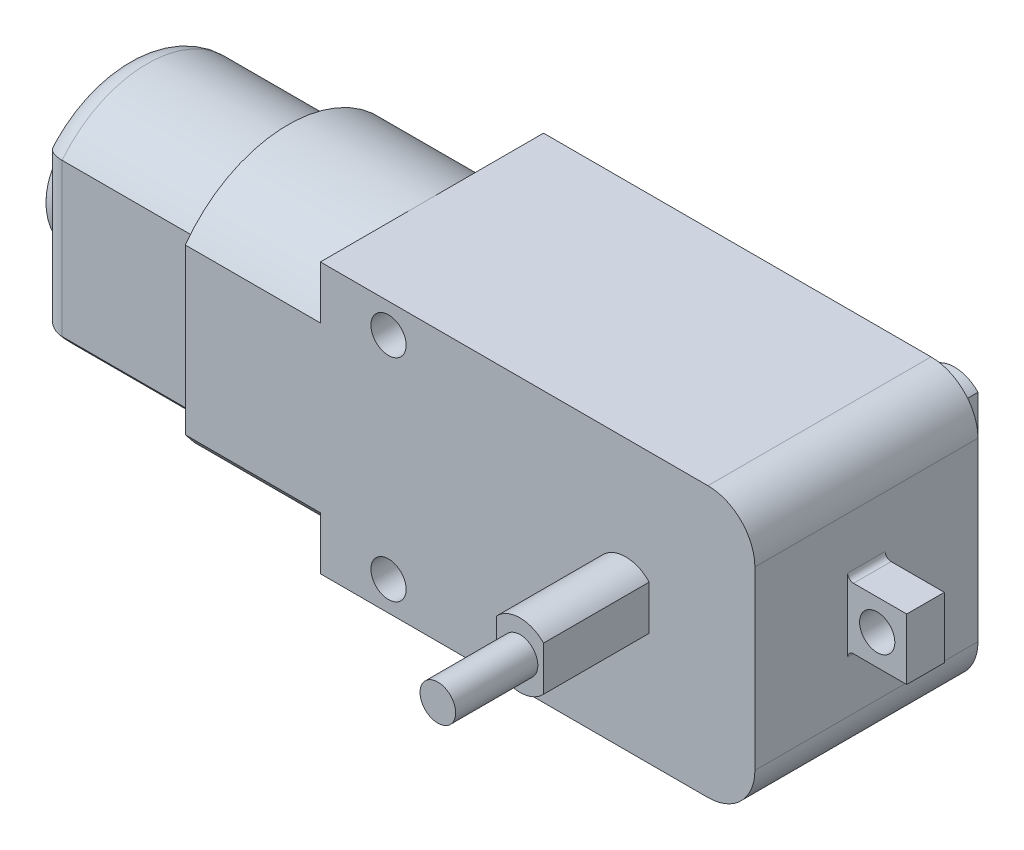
from build123d import *

# Parameters (mm, degrees)
ESBO_O1_W                     = 19
ESBO_O1_H                     = 23
RESSALTO_EXTRUS_O1_DEPTH      = 37
FILETE3_R                     = 4
ESBO_O2_W                     = 3.2
ESBO_O2_H                     = 5.2
RESSALTO_EXTRUS_O2_DEPTH      = 5.030814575
ESBO_O4_R                     = 1.5
CORTE_EXTRUS_O1_DEPTH         = 45.967203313
FILETE4_R                     = 0.5
FILETE5_R                     = 0.5
RESSALTO_EXTRUS_O6_DEPTH      = 9
RESSALTO_EXTRUS_O6_DEPTH_BACK = 28
ESBO_O10_R                    = 2
RESSALTO_EXTRUS_O7_DEPTH      = 2
RESSALTO_EXTRUS_O8_DEPTH      = 11.5
RESSALTO_EXTRUS_O9_DEPTH      = 14
FILETE6_R                     = 2
ESBO_O13_R                    = 5
ESBO_O13_R_2                  = 1
RESSALTO_EXTRUS_O12_DEPTH     = 2.5
FILETE7_R                     = 1.5
ESBO_O14_R                    = 1.5
CORTE_EXTRUS_O2_DEPTH         = 52.796132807
ESBO_O16_R                    = 1.516823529
RESSALTO_EXTRUS_O14_DEPTH     = 7


with BuildPart() as part:
    # Esbo_o1 → Ressalto-extrus_o1 (new body)
    with BuildSketch(Plane(origin=(0, 0, 0), x_dir=(0, 0, -1), z_dir=(1, 0, 0))):
        Rectangle(ESBO_O1_W, ESBO_O1_H)
    extrude(amount=RESSALTO_EXTRUS_O1_DEPTH)

    # Filete3
    filete3_edges = [part.edges().sort_by_distance(p)[0] for p in [
        (37, -11.5, 0),
        (37, 11.5, 0),
    ]]
    fillet(filete3_edges, radius=FILETE3_R)

    # Esbo_o2 → Ressalto-extrus_o2 (add)
    with BuildSketch(Plane(origin=(37, 0, 0), x_dir=(0, 0, -1), z_dir=(1, 0, 0))):
        Rectangle(ESBO_O2_W, ESBO_O2_H)
    extrude(amount=RESSALTO_EXTRUS_O2_DEPTH)

    # Esbo_o4 → Corte-extrus_o1 (cut, through all)
    with BuildSketch(Plane(origin=(0, 0, -1.6), x_dir=(-1, 0, 0), z_dir=(0, 0, -1))):
        with Locations((-39.515407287, 0)):
            Circle(ESBO_O4_R)
    extrude(amount=-CORTE_EXTRUS_O1_DEPTH, mode=Mode.SUBTRACT)

    # Filete4
    filete4_edges = [part.edges().sort_by_distance(p)[0] for p in [
        (37, 2.6, 0),
    ]]
    fillet(filete4_edges, radius=FILETE4_R)

    # Filete5
    filete5_edges = [part.edges().sort_by_distance(p)[0] for p in [
        (37, -2.6, 0),
    ]]
    fillet(filete5_edges, radius=FILETE5_R)

    # Esbo_o6 → Ressalto-extrus_o6 (add, two sides: drawn at the far end of the back side and taken through both)
    with BuildSketch(Plane(origin=(0, 0, -9.5), x_dir=(-1, 0, 0), z_dir=(0, 0, -1)).offset(-RESSALTO_EXTRUS_O6_DEPTH_BACK)):
        with BuildLine():
            Line((-28, -1.887458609), (-28, 1.887458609))
            ThreePointArc((-28, 1.887458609), (-26, 2.75), (-24, 1.887458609))
            Line((-24, 1.887458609), (-24, -1.887458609))
            ThreePointArc((-24, -1.887458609), (-26, -2.75), (-28, -1.887458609))
        make_face()
    extrude(amount=RESSALTO_EXTRUS_O6_DEPTH + RESSALTO_EXTRUS_O6_DEPTH_BACK)

    # Esbo_o10 → Ressalto-extrus_o7 (add)
    with BuildSketch(Plane(origin=(0, 0, -9.5), x_dir=(-1, 0, 0), z_dir=(0, 0, -1))):
        with Locations(Location((-14, 0, 0), (0, 0, 180))):
            Circle(ESBO_O10_R)
    extrude(amount=RESSALTO_EXTRUS_O7_DEPTH)

    # Esbo_o11 → Ressalto-extrus_o8 (add)
    with BuildSketch(Plane.ZY):
        with BuildLine():
            Line((9.5, -7), (9.5, 7))
            ThreePointArc((9.5, 7), (0.75, 11.5), (-8, 7))
            Line((-8, 7), (-8, -7))
            ThreePointArc((-8, -7), (0.75, -11.5), (9.5, -7))
        make_face()
    extrude(amount=RESSALTO_EXTRUS_O8_DEPTH)

    # Esbo_o12 → Ressalto-extrus_o9 (add)
    with BuildSketch(Plane.ZY.offset(11.5)):
        with BuildLine():
            Line((-6.5, 6.498793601), (-6.5, -6.498793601))
            ThreePointArc((-6.5, -6.498793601), (0.75, -10), (8, -6.498793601))
            Line((8, -6.498793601), (8, 6.498793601))
            ThreePointArc((8, 6.498793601), (0.75, 10), (-6.5, 6.498793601))
        make_face()
    extrude(amount=RESSALTO_EXTRUS_O9_DEPTH)

    # Filete6
    filete6_edges = [part.edges().sort_by_distance(p)[0] for p in [
        (-25.5, 10, 0.75),
        (-25.5, 0, -6.5),
        (-25.5, -10, 0.75),
        (-25.5, 0, 8),
    ]]
    fillet(filete6_edges, radius=FILETE6_R)

    # Esbo_o13 → Ressalto-extrus_o12 (add)
    with BuildSketch(Plane.ZY.offset(25.5)):
        with Locations((0.75, 0)):
            Circle(ESBO_O13_R)
        with Locations((0.75, 0)):
            Circle(ESBO_O13_R_2, mode=Mode.SUBTRACT)
    extrude(amount=RESSALTO_EXTRUS_O12_DEPTH)

    # Filete7
    filete7_edges = [part.edges().sort_by_distance(p)[0] for p in [
        (-28, 0, -4.25),
    ]]
    fillet(filete7_edges, radius=FILETE7_R)

    # Esbo_o14 → Corte-extrus_o2 (cut, through all)
    with BuildSketch(Plane(origin=(0, 0, -9.5), x_dir=(-1, 0, 0), z_dir=(0, 0, -1))):
        with Locations((-5.8, 9)):
            Circle(ESBO_O14_R)
        with Locations((-5.8, -9)):
            Circle(ESBO_O14_R)
    extrude(amount=-CORTE_EXTRUS_O2_DEPTH, mode=Mode.SUBTRACT)

    # Esbo_o16 → Ressalto-extrus_o14 (add)
    with BuildSketch(Plane.XY.offset(18.5)):
        with Locations(Location((26, 0, 0), (0, 0, 180))):
            Circle(ESBO_O16_R)
    extrude(amount=RESSALTO_EXTRUS_O14_DEPTH)


solid = part.part
